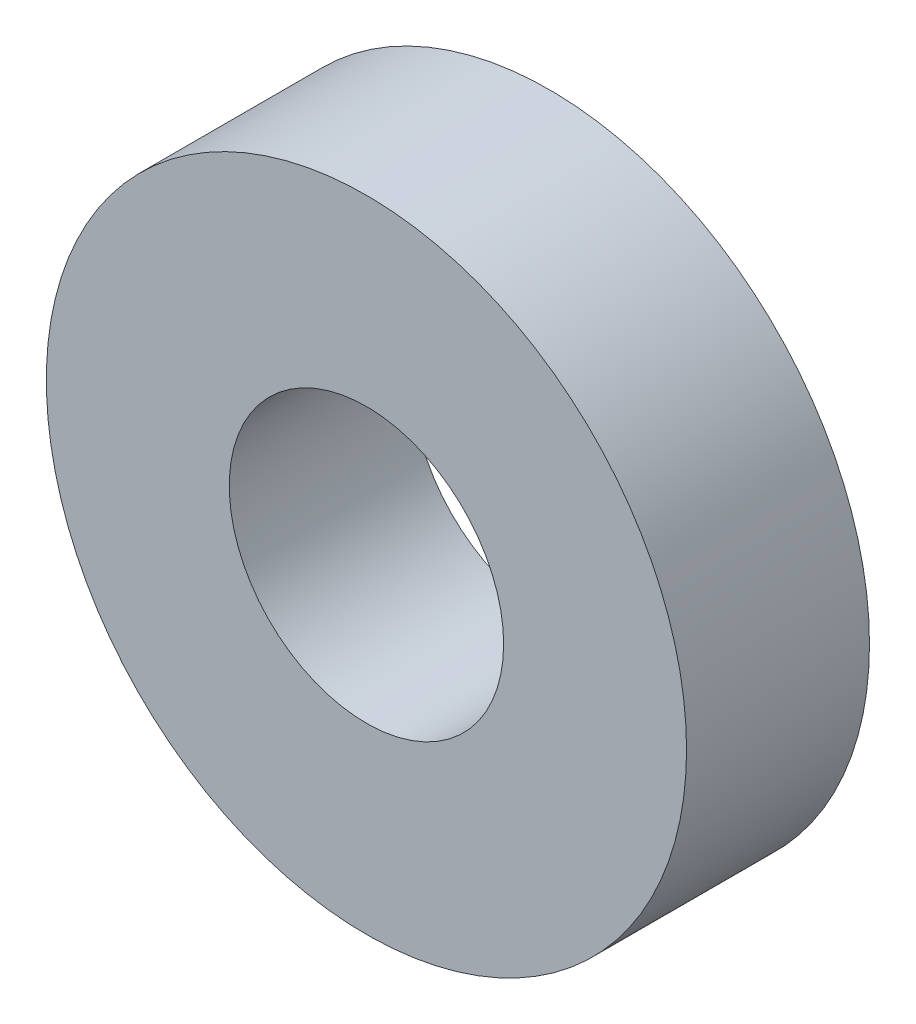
from build123d import *

# Parameters (mm, degrees)
SKETCH_1_R      = 3.5
SKETCH_1_R_2    = 1.5
EXTRUDE_1_DEPTH = 2


with BuildPart() as part:
    # Sketch 1 → Extrude 1 (new body)
    with BuildSketch(Plane.XY):
        Circle(SKETCH_1_R)
        Circle(SKETCH_1_R_2, mode=Mode.SUBTRACT)
    extrude(amount=EXTRUDE_1_DEPTH)


solid = part.part
